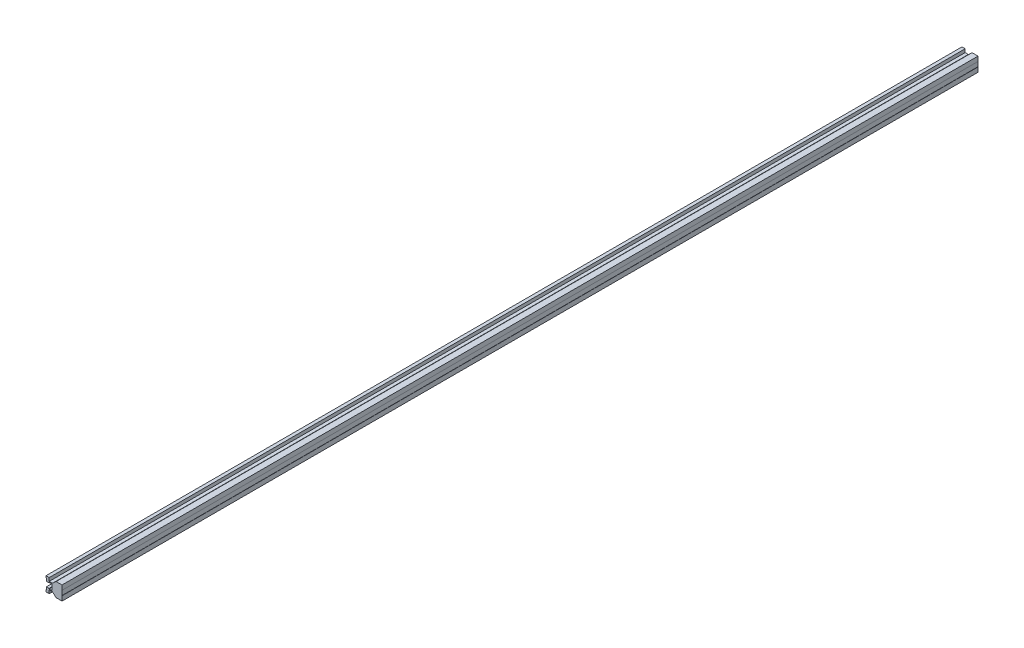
ISO-10303-21;
HEADER;
FILE_DESCRIPTION(('STEP AP214'),'2;1');
FILE_NAME('part.step','',(''),(''),'','','');
FILE_SCHEMA(('AUTOMOTIVE_DESIGN { 1 0 10303 214 1 1 1 1 }'));
ENDSEC;
DATA;
#1=APPLICATION_CONTEXT('core data for automotive mechanical design processes');
#2=APPLICATION_PROTOCOL_DEFINITION('international standard','automotive_design',2000,#1);
#3=PRODUCT_CONTEXT('',#1,'mechanical');
#4=PRODUCT('Part','Part','',(#3));
#5=PRODUCT_RELATED_PRODUCT_CATEGORY('part','',(#4));
#6=PRODUCT_DEFINITION_FORMATION('','',#4);
#7=PRODUCT_DEFINITION_CONTEXT('part definition',#1,'design');
#8=PRODUCT_DEFINITION('design','',#6,#7);
#9=PRODUCT_DEFINITION_SHAPE('','',#8);
#10=(LENGTH_UNIT() NAMED_UNIT(*) SI_UNIT(.MILLI.,.METRE.));
#11=(NAMED_UNIT(*) PLANE_ANGLE_UNIT() SI_UNIT($,.RADIAN.));
#12=(NAMED_UNIT(*) SI_UNIT($,.STERADIAN.) SOLID_ANGLE_UNIT());
#13=UNCERTAINTY_MEASURE_WITH_UNIT(LENGTH_MEASURE(1.E-05),#10,'distance_accuracy_value','');
#14=(GEOMETRIC_REPRESENTATION_CONTEXT(3) GLOBAL_UNCERTAINTY_ASSIGNED_CONTEXT((#13)) GLOBAL_UNIT_ASSIGNED_CONTEXT((#10,
#11,#12)) REPRESENTATION_CONTEXT('',''));
#15=CARTESIAN_POINT('',(0.,0.,0.));
#16=DIRECTION('',(0.,0.,1.));
#17=DIRECTION('',(1.,0.,0.));
#18=AXIS2_PLACEMENT_3D('',#15,#16,#17);
#19=CARTESIAN_POINT('',(1772.75,-14.8,12.));
#20=DIRECTION('',(0.,-1.,0.));
#21=DIRECTION('',(0.,0.,-1.));
#22=AXIS2_PLACEMENT_3D('',#19,#20,#21);
#23=PLANE('',#22);
#24=DIRECTION('',(1.,0.,0.));
#25=VECTOR('',#24,1.);
#26=CARTESIAN_POINT('',(1772.75,-14.8,12.));
#27=LINE('',#26,#25);
#28=CARTESIAN_POINT('',(1772.5,-14.8,12.));
#29=VERTEX_POINT('',#28);
#30=CARTESIAN_POINT('',(1773.,-14.8,12.));
#31=VERTEX_POINT('',#30);
#32=EDGE_CURVE('E336',#29,#31,#27,.T.);
#33=ORIENTED_EDGE('',*,*,#32,.T.);
#34=DIRECTION('',(0.,0.,-1.));
#35=VECTOR('',#34,1.);
#36=CARTESIAN_POINT('',(1773.,-14.8,12.));
#37=LINE('',#36,#35);
#38=CARTESIAN_POINT('',(1773.,-14.8,2012.));
#39=VERTEX_POINT('',#38);
#40=EDGE_CURVE('E315',#39,#31,#37,.T.);
#41=ORIENTED_EDGE('',*,*,#40,.F.);
#42=DIRECTION('',(1.,0.,0.));
#43=VECTOR('',#42,1.);
#44=CARTESIAN_POINT('',(1772.75,-14.8,2012.));
#45=LINE('',#44,#43);
#46=CARTESIAN_POINT('',(1772.5,-14.8,2012.));
#47=VERTEX_POINT('',#46);
#48=EDGE_CURVE('E20',#39,#47,#45,.F.);
#49=ORIENTED_EDGE('',*,*,#48,.T.);
#50=DIRECTION('',(0.,0.,-1.));
#51=VECTOR('',#50,1.);
#52=CARTESIAN_POINT('',(1772.5,-14.8,12.));
#53=LINE('',#52,#51);
#54=EDGE_CURVE('E221',#29,#47,#53,.F.);
#55=ORIENTED_EDGE('',*,*,#54,.F.);
#56=EDGE_LOOP('',(#33,#41,#49,#55));
#57=FACE_BOUND('',#56,.T.);
#58=ADVANCED_FACE('F17',(#57),#23,.T.);
#59=CARTESIAN_POINT('',(1738.5,-8.7,12.));
#60=DIRECTION('',(0.,-1.,0.));
#61=DIRECTION('',(0.,0.,-1.));
#62=AXIS2_PLACEMENT_3D('',#59,#60,#61);
#63=PLANE('',#62);
#64=DIRECTION('',(1.,0.,0.));
#65=VECTOR('',#64,1.);
#66=CARTESIAN_POINT('',(1738.5,-8.7,12.));
#67=LINE('',#66,#65);
#68=CARTESIAN_POINT('',(1738.,-8.7,12.));
#69=VERTEX_POINT('',#68);
#70=CARTESIAN_POINT('',(1739.,-8.7,12.));
#71=VERTEX_POINT('',#70);
#72=EDGE_CURVE('E333',#69,#71,#67,.T.);
#73=ORIENTED_EDGE('',*,*,#72,.T.);
#74=DIRECTION('',(0.,0.,1.));
#75=VECTOR('',#74,1.);
#76=CARTESIAN_POINT('',(1739.,-8.7,12.));
#77=LINE('',#76,#75);
#78=CARTESIAN_POINT('',(1739.,-8.7,2012.));
#79=VERTEX_POINT('',#78);
#80=EDGE_CURVE('E283',#79,#71,#77,.F.);
#81=ORIENTED_EDGE('',*,*,#80,.F.);
#82=DIRECTION('',(1.,0.,0.));
#83=VECTOR('',#82,1.);
#84=CARTESIAN_POINT('',(1738.5,-8.7,2012.));
#85=LINE('',#84,#83);
#86=CARTESIAN_POINT('',(1738.,-8.7,2012.));
#87=VERTEX_POINT('',#86);
#88=EDGE_CURVE('E335',#79,#87,#85,.F.);
#89=ORIENTED_EDGE('',*,*,#88,.T.);
#90=DIRECTION('',(0.,0.,1.));
#91=VECTOR('',#90,1.);
#92=CARTESIAN_POINT('',(1738.,-8.7,12.));
#93=LINE('',#92,#91);
#94=EDGE_CURVE('E287',#69,#87,#93,.T.);
#95=ORIENTED_EDGE('',*,*,#94,.F.);
#96=EDGE_LOOP('',(#73,#81,#89,#95));
#97=FACE_BOUND('',#96,.T.);
#98=ADVANCED_FACE('F439',(#97),#63,.T.);
#99=CARTESIAN_POINT('',(1745.,-14.4,12.));
#100=DIRECTION('',(1.,0.,0.));
#101=DIRECTION('',(0.,0.,-1.));
#102=AXIS2_PLACEMENT_3D('',#99,#100,#101);
#103=PLANE('',#102);
#104=DIRECTION('',(0.,1.,0.));
#105=VECTOR('',#104,1.);
#106=CARTESIAN_POINT('',(1745.,-14.4,12.));
#107=LINE('',#106,#105);
#108=CARTESIAN_POINT('',(1745.,-14.9,12.));
#109=VERTEX_POINT('',#108);
#110=CARTESIAN_POINT('',(1745.,-13.9,12.));
#111=VERTEX_POINT('',#110);
#112=EDGE_CURVE('E329',#109,#111,#107,.T.);
#113=ORIENTED_EDGE('',*,*,#112,.T.);
#114=DIRECTION('',(0.,0.,-1.));
#115=VECTOR('',#114,1.);
#116=CARTESIAN_POINT('',(1745.,-13.9,12.));
#117=LINE('',#116,#115);
#118=CARTESIAN_POINT('',(1745.,-13.9,2012.));
#119=VERTEX_POINT('',#118);
#120=EDGE_CURVE('E271',#119,#111,#117,.T.);
#121=ORIENTED_EDGE('',*,*,#120,.F.);
#122=DIRECTION('',(0.,1.,0.));
#123=VECTOR('',#122,1.);
#124=CARTESIAN_POINT('',(1745.,-14.4,2012.));
#125=LINE('',#124,#123);
#126=CARTESIAN_POINT('',(1745.,-14.9,2012.));
#127=VERTEX_POINT('',#126);
#128=EDGE_CURVE('E331',#119,#127,#125,.F.);
#129=ORIENTED_EDGE('',*,*,#128,.T.);
#130=DIRECTION('',(0.,0.,-1.));
#131=VECTOR('',#130,1.);
#132=CARTESIAN_POINT('',(1745.,-14.9,12.));
#133=LINE('',#132,#131);
#134=EDGE_CURVE('E275',#109,#127,#133,.F.);
#135=ORIENTED_EDGE('',*,*,#134,.F.);
#136=EDGE_LOOP('',(#113,#121,#129,#135));
#137=FACE_BOUND('',#136,.T.);
#138=ADVANCED_FACE('F453',(#137),#103,.T.);
#139=CARTESIAN_POINT('',(1745.,-25.6,12.));
#140=DIRECTION('',(1.,0.,0.));
#141=DIRECTION('',(0.,0.,-1.));
#142=AXIS2_PLACEMENT_3D('',#139,#140,#141);
#143=PLANE('',#142);
#144=DIRECTION('',(0.,1.,0.));
#145=VECTOR('',#144,1.);
#146=CARTESIAN_POINT('',(1745.,-25.6,12.));
#147=LINE('',#146,#145);
#148=CARTESIAN_POINT('',(1745.,-26.1,12.));
#149=VERTEX_POINT('',#148);
#150=CARTESIAN_POINT('',(1745.,-25.1,12.));
#151=VERTEX_POINT('',#150);
#152=EDGE_CURVE('E325',#149,#151,#147,.T.);
#153=ORIENTED_EDGE('',*,*,#152,.T.);
#154=DIRECTION('',(0.,0.,1.));
#155=VECTOR('',#154,1.);
#156=CARTESIAN_POINT('',(1745.,-25.1,12.));
#157=LINE('',#156,#155);
#158=CARTESIAN_POINT('',(1745.,-25.1,2012.));
#159=VERTEX_POINT('',#158);
#160=EDGE_CURVE('E255',#159,#151,#157,.F.);
#161=ORIENTED_EDGE('',*,*,#160,.F.);
#162=DIRECTION('',(0.,1.,0.));
#163=VECTOR('',#162,1.);
#164=CARTESIAN_POINT('',(1745.,-25.6,2012.));
#165=LINE('',#164,#163);
#166=CARTESIAN_POINT('',(1745.,-26.1,2012.));
#167=VERTEX_POINT('',#166);
#168=EDGE_CURVE('E327',#159,#167,#165,.F.);
#169=ORIENTED_EDGE('',*,*,#168,.T.);
#170=DIRECTION('',(0.,0.,1.));
#171=VECTOR('',#170,1.);
#172=CARTESIAN_POINT('',(1745.,-26.1,12.));
#173=LINE('',#172,#171);
#174=EDGE_CURVE('E259',#149,#167,#173,.T.);
#175=ORIENTED_EDGE('',*,*,#174,.F.);
#176=EDGE_LOOP('',(#153,#161,#169,#175));
#177=FACE_BOUND('',#176,.T.);
#178=ADVANCED_FACE('F471',(#177),#143,.T.);
#179=CARTESIAN_POINT('',(1738.5,-31.3,12.));
#180=DIRECTION('',(0.,1.,0.));
#181=DIRECTION('',(0.,0.,1.));
#182=AXIS2_PLACEMENT_3D('',#179,#180,#181);
#183=PLANE('',#182);
#184=DIRECTION('',(1.,0.,0.));
#185=VECTOR('',#184,1.);
#186=CARTESIAN_POINT('',(1738.5,-31.3,12.));
#187=LINE('',#186,#185);
#188=CARTESIAN_POINT('',(1739.,-31.3,12.));
#189=VERTEX_POINT('',#188);
#190=CARTESIAN_POINT('',(1738.,-31.3,12.));
#191=VERTEX_POINT('',#190);
#192=EDGE_CURVE('E321',#189,#191,#187,.F.);
#193=ORIENTED_EDGE('',*,*,#192,.T.);
#194=DIRECTION('',(0.,0.,1.));
#195=VECTOR('',#194,1.);
#196=CARTESIAN_POINT('',(1738.,-31.3,12.));
#197=LINE('',#196,#195);
#198=CARTESIAN_POINT('',(1738.,-31.3,2012.));
#199=VERTEX_POINT('',#198);
#200=EDGE_CURVE('E243',#199,#191,#197,.F.);
#201=ORIENTED_EDGE('',*,*,#200,.F.);
#202=DIRECTION('',(1.,0.,0.));
#203=VECTOR('',#202,1.);
#204=CARTESIAN_POINT('',(1738.5,-31.3,2012.));
#205=LINE('',#204,#203);
#206=CARTESIAN_POINT('',(1739.,-31.3,2012.));
#207=VERTEX_POINT('',#206);
#208=EDGE_CURVE('E323',#199,#207,#205,.T.);
#209=ORIENTED_EDGE('',*,*,#208,.T.);
#210=DIRECTION('',(0.,0.,1.));
#211=VECTOR('',#210,1.);
#212=CARTESIAN_POINT('',(1739.,-31.3,12.));
#213=LINE('',#212,#211);
#214=EDGE_CURVE('E247',#189,#207,#213,.T.);
#215=ORIENTED_EDGE('',*,*,#214,.F.);
#216=EDGE_LOOP('',(#193,#201,#209,#215));
#217=FACE_BOUND('',#216,.T.);
#218=ADVANCED_FACE('F485',(#217),#183,.T.);
#219=CARTESIAN_POINT('',(1772.5,-20.,12.));
#220=DIRECTION('',(1.,0.,0.));
#221=DIRECTION('',(0.,0.,-1.));
#222=AXIS2_PLACEMENT_3D('',#219,#220,#221);
#223=PLANE('',#222);
#224=DIRECTION('',(0.,1.,0.));
#225=VECTOR('',#224,1.);
#226=CARTESIAN_POINT('',(1772.5,-20.,12.));
#227=LINE('',#226,#225);
#228=CARTESIAN_POINT('',(1772.5,-25.2,12.));
#229=VERTEX_POINT('',#228);
#230=EDGE_CURVE('E347',#229,#29,#227,.T.);
#231=ORIENTED_EDGE('',*,*,#230,.T.);
#232=ORIENTED_EDGE('',*,*,#54,.T.);
#233=DIRECTION('',(0.,1.,0.));
#234=VECTOR('',#233,1.);
#235=CARTESIAN_POINT('',(1772.5,-20.,2012.));
#236=LINE('',#235,#234);
#237=CARTESIAN_POINT('',(1772.5,-25.2,2012.));
#238=VERTEX_POINT('',#237);
#239=EDGE_CURVE('E219',#238,#47,#236,.T.);
#240=ORIENTED_EDGE('',*,*,#239,.F.);
#241=DIRECTION('',(0.,0.,1.));
#242=VECTOR('',#241,1.);
#243=CARTESIAN_POINT('',(1772.5,-25.2,12.));
#244=LINE('',#243,#242);
#245=EDGE_CURVE('E204',#229,#238,#244,.T.);
#246=ORIENTED_EDGE('',*,*,#245,.F.);
#247=EDGE_LOOP('',(#231,#232,#240,#246));
#248=FACE_BOUND('',#247,.T.);
#249=ADVANCED_FACE('F220',(#248),#223,.T.);
#250=CARTESIAN_POINT('',(1773.,-9.75,12.));
#251=DIRECTION('',(1.,0.,0.));
#252=DIRECTION('',(0.,0.,-1.));
#253=AXIS2_PLACEMENT_3D('',#250,#251,#252);
#254=PLANE('',#253);
#255=DIRECTION('',(0.,1.,0.));
#256=VECTOR('',#255,1.);
#257=CARTESIAN_POINT('',(1773.,-20.,12.));
#258=LINE('',#257,#256);
#259=CARTESIAN_POINT('',(1773.,-4.7,12.));
#260=VERTEX_POINT('',#259);
#261=EDGE_CURVE('E341',#31,#260,#258,.T.);
#262=ORIENTED_EDGE('',*,*,#261,.T.);
#263=DIRECTION('',(0.,0.,1.));
#264=VECTOR('',#263,1.);
#265=CARTESIAN_POINT('',(1773.,-4.7,12.));
#266=LINE('',#265,#264);
#267=CARTESIAN_POINT('',(1773.,-4.7,2012.));
#268=VERTEX_POINT('',#267);
#269=EDGE_CURVE('E311',#268,#260,#266,.F.);
#270=ORIENTED_EDGE('',*,*,#269,.F.);
#271=DIRECTION('',(0.,1.,0.));
#272=VECTOR('',#271,1.);
#273=CARTESIAN_POINT('',(1773.,-20.,2012.));
#274=LINE('',#273,#272);
#275=EDGE_CURVE('E223',#39,#268,#274,.T.);
#276=ORIENTED_EDGE('',*,*,#275,.F.);
#277=ORIENTED_EDGE('',*,*,#40,.T.);
#278=EDGE_LOOP('',(#262,#270,#276,#277));
#279=FACE_BOUND('',#278,.T.);
#280=ADVANCED_FACE('F340',(#279),#254,.T.);
#281=CARTESIAN_POINT('',(1766.5,-4.7,12.));
#282=DIRECTION('',(0.,1.,0.));
#283=DIRECTION('',(0.,0.,1.));
#284=AXIS2_PLACEMENT_3D('',#281,#282,#283);
#285=PLANE('',#284);
#286=DIRECTION('',(1.,0.,0.));
#287=VECTOR('',#286,1.);
#288=CARTESIAN_POINT('',(1753.80417748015,-4.7,12.));
#289=LINE('',#288,#287);
#290=CARTESIAN_POINT('',(1760.,-4.7,12.));
#291=VERTEX_POINT('',#290);
#292=EDGE_CURVE('E346',#260,#291,#289,.F.);
#293=ORIENTED_EDGE('',*,*,#292,.T.);
#294=DIRECTION('',(0.,0.,1.));
#295=VECTOR('',#294,1.);
#296=CARTESIAN_POINT('',(1760.,-4.7,12.));
#297=LINE('',#296,#295);
#298=CARTESIAN_POINT('',(1760.,-4.7,2012.));
#299=VERTEX_POINT('',#298);
#300=EDGE_CURVE('E307',#299,#291,#297,.F.);
#301=ORIENTED_EDGE('',*,*,#300,.F.);
#302=DIRECTION('',(1.,0.,0.));
#303=VECTOR('',#302,1.);
#304=CARTESIAN_POINT('',(1753.80417748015,-4.7,2012.));
#305=LINE('',#304,#303);
#306=EDGE_CURVE('E408',#268,#299,#305,.F.);
#307=ORIENTED_EDGE('',*,*,#306,.F.);
#308=ORIENTED_EDGE('',*,*,#269,.T.);
#309=EDGE_LOOP('',(#293,#301,#307,#308));
#310=FACE_BOUND('',#309,.T.);
#311=ADVANCED_FACE('F413',(#310),#285,.T.);
#312=CARTESIAN_POINT('',(1756.,-8.35,12.));
#313=DIRECTION('',(-0.674050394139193,0.738685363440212,0.));
#314=DIRECTION('',(-0.738685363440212,-0.674050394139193,0.));
#315=AXIS2_PLACEMENT_3D('',#312,#313,#314);
#316=PLANE('',#315);
#317=DIRECTION('',(-0.738685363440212,-0.674050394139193,0.));
#318=VECTOR('',#317,1.);
#319=CARTESIAN_POINT('',(1760.,-4.7,12.));
#320=LINE('',#319,#318);
#321=CARTESIAN_POINT('',(1752.,-12.,12.));
#322=VERTEX_POINT('',#321);
#323=EDGE_CURVE('E349',#291,#322,#320,.T.);
#324=ORIENTED_EDGE('',*,*,#323,.T.);
#325=DIRECTION('',(0.,0.,1.));
#326=VECTOR('',#325,1.);
#327=CARTESIAN_POINT('',(1752.,-12.,12.));
#328=LINE('',#327,#326);
#329=CARTESIAN_POINT('',(1752.,-12.,2012.));
#330=VERTEX_POINT('',#329);
#331=EDGE_CURVE('E303',#330,#322,#328,.F.);
#332=ORIENTED_EDGE('',*,*,#331,.F.);
#333=DIRECTION('',(-0.738685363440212,-0.674050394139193,0.));
#334=VECTOR('',#333,1.);
#335=CARTESIAN_POINT('',(1760.,-4.7,2012.));
#336=LINE('',#335,#334);
#337=EDGE_CURVE('E405',#299,#330,#336,.T.);
#338=ORIENTED_EDGE('',*,*,#337,.F.);
#339=ORIENTED_EDGE('',*,*,#300,.T.);
#340=EDGE_LOOP('',(#324,#332,#338,#339));
#341=FACE_BOUND('',#340,.T.);
#342=ADVANCED_FACE('F415',(#341),#316,.T.);
#343=CARTESIAN_POINT('',(1748.5,-12.,12.));
#344=DIRECTION('',(0.,1.,0.));
#345=DIRECTION('',(0.,0.,1.));
#346=AXIS2_PLACEMENT_3D('',#343,#344,#345);
#347=PLANE('',#346);
#348=DIRECTION('',(1.,0.,0.));
#349=VECTOR('',#348,1.);
#350=CARTESIAN_POINT('',(1753.80417748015,-12.,12.));
#351=LINE('',#350,#349);
#352=CARTESIAN_POINT('',(1745.,-12.,12.));
#353=VERTEX_POINT('',#352);
#354=EDGE_CURVE('E549',#322,#353,#351,.F.);
#355=ORIENTED_EDGE('',*,*,#354,.T.);
#356=DIRECTION('',(0.,0.,-1.));
#357=VECTOR('',#356,1.);
#358=CARTESIAN_POINT('',(1745.,-12.,12.));
#359=LINE('',#358,#357);
#360=CARTESIAN_POINT('',(1745.,-12.,2012.));
#361=VERTEX_POINT('',#360);
#362=EDGE_CURVE('E299',#361,#353,#359,.T.);
#363=ORIENTED_EDGE('',*,*,#362,.F.);
#364=DIRECTION('',(1.,0.,0.));
#365=VECTOR('',#364,1.);
#366=CARTESIAN_POINT('',(1753.80417748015,-12.,2012.));
#367=LINE('',#366,#365);
#368=EDGE_CURVE('E402',#330,#361,#367,.F.);
#369=ORIENTED_EDGE('',*,*,#368,.F.);
#370=ORIENTED_EDGE('',*,*,#331,.T.);
#371=EDGE_LOOP('',(#355,#363,#369,#370));
#372=FACE_BOUND('',#371,.T.);
#373=ADVANCED_FACE('F419',(#372),#347,.T.);
#374=CARTESIAN_POINT('',(1745.,-8.35,12.));
#375=DIRECTION('',(1.,0.,0.));
#376=DIRECTION('',(0.,0.,-1.));
#377=AXIS2_PLACEMENT_3D('',#374,#375,#376);
#378=PLANE('',#377);
#379=DIRECTION('',(0.,1.,0.));
#380=VECTOR('',#379,1.);
#381=CARTESIAN_POINT('',(1745.,-20.,12.));
#382=LINE('',#381,#380);
#383=CARTESIAN_POINT('',(1745.,-4.7,12.));
#384=VERTEX_POINT('',#383);
#385=EDGE_CURVE('E425',#353,#384,#382,.T.);
#386=ORIENTED_EDGE('',*,*,#385,.T.);
#387=DIRECTION('',(0.,0.,1.));
#388=VECTOR('',#387,1.);
#389=CARTESIAN_POINT('',(1745.,-4.7,12.));
#390=LINE('',#389,#388);
#391=CARTESIAN_POINT('',(1745.,-4.7,2012.));
#392=VERTEX_POINT('',#391);
#393=EDGE_CURVE('E295',#392,#384,#390,.F.);
#394=ORIENTED_EDGE('',*,*,#393,.F.);
#395=DIRECTION('',(0.,1.,0.));
#396=VECTOR('',#395,1.);
#397=CARTESIAN_POINT('',(1745.,-20.,2012.));
#398=LINE('',#397,#396);
#399=EDGE_CURVE('E399',#361,#392,#398,.T.);
#400=ORIENTED_EDGE('',*,*,#399,.F.);
#401=ORIENTED_EDGE('',*,*,#362,.T.);
#402=EDGE_LOOP('',(#386,#394,#400,#401));
#403=FACE_BOUND('',#402,.T.);
#404=ADVANCED_FACE('F423',(#403),#378,.T.);
#405=CARTESIAN_POINT('',(1741.5,-4.7,12.));
#406=DIRECTION('',(0.,1.,0.));
#407=DIRECTION('',(0.,0.,1.));
#408=AXIS2_PLACEMENT_3D('',#405,#406,#407);
#409=PLANE('',#408);
#410=DIRECTION('',(1.,0.,0.));
#411=VECTOR('',#410,1.);
#412=CARTESIAN_POINT('',(1753.80417748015,-4.7,12.));
#413=LINE('',#412,#411);
#414=CARTESIAN_POINT('',(1738.,-4.7,12.));
#415=VERTEX_POINT('',#414);
#416=EDGE_CURVE('E430',#384,#415,#413,.F.);
#417=ORIENTED_EDGE('',*,*,#416,.T.);
#418=DIRECTION('',(0.,0.,1.));
#419=VECTOR('',#418,1.);
#420=CARTESIAN_POINT('',(1738.,-4.7,12.));
#421=LINE('',#420,#419);
#422=CARTESIAN_POINT('',(1738.,-4.7,2012.));
#423=VERTEX_POINT('',#422);
#424=EDGE_CURVE('E291',#423,#415,#421,.F.);
#425=ORIENTED_EDGE('',*,*,#424,.F.);
#426=DIRECTION('',(1.,0.,0.));
#427=VECTOR('',#426,1.);
#428=CARTESIAN_POINT('',(1753.80417748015,-4.7,2012.));
#429=LINE('',#428,#427);
#430=EDGE_CURVE('E396',#392,#423,#429,.F.);
#431=ORIENTED_EDGE('',*,*,#430,.F.);
#432=ORIENTED_EDGE('',*,*,#393,.T.);
#433=EDGE_LOOP('',(#417,#425,#431,#432));
#434=FACE_BOUND('',#433,.T.);
#435=ADVANCED_FACE('F428',(#434),#409,.T.);
#436=CARTESIAN_POINT('',(1738.,-6.7,12.));
#437=DIRECTION('',(-1.,0.,0.));
#438=DIRECTION('',(0.,0.,1.));
#439=AXIS2_PLACEMENT_3D('',#436,#437,#438);
#440=PLANE('',#439);
#441=DIRECTION('',(0.,1.,0.));
#442=VECTOR('',#441,1.);
#443=CARTESIAN_POINT('',(1738.,-20.,12.));
#444=LINE('',#443,#442);
#445=EDGE_CURVE('E545',#415,#69,#444,.F.);
#446=ORIENTED_EDGE('',*,*,#445,.T.);
#447=ORIENTED_EDGE('',*,*,#94,.T.);
#448=DIRECTION('',(0.,1.,0.));
#449=VECTOR('',#448,1.);
#450=CARTESIAN_POINT('',(1738.,-20.,2012.));
#451=LINE('',#450,#449);
#452=EDGE_CURVE('E393',#423,#87,#451,.F.);
#453=ORIENTED_EDGE('',*,*,#452,.F.);
#454=ORIENTED_EDGE('',*,*,#424,.T.);
#455=EDGE_LOOP('',(#446,#447,#453,#454));
#456=FACE_BOUND('',#455,.T.);
#457=ADVANCED_FACE('F434',(#456),#440,.T.);
#458=CARTESIAN_POINT('',(1739.,-11.8,12.));
#459=DIRECTION('',(-1.,0.,0.));
#460=DIRECTION('',(0.,0.,1.));
#461=AXIS2_PLACEMENT_3D('',#458,#459,#460);
#462=PLANE('',#461);
#463=DIRECTION('',(0.,1.,0.));
#464=VECTOR('',#463,1.);
#465=CARTESIAN_POINT('',(1739.,-20.,12.));
#466=LINE('',#465,#464);
#467=CARTESIAN_POINT('',(1739.,-14.9,12.));
#468=VERTEX_POINT('',#467);
#469=EDGE_CURVE('E444',#71,#468,#466,.F.);
#470=ORIENTED_EDGE('',*,*,#469,.T.);
#471=DIRECTION('',(0.,0.,-1.));
#472=VECTOR('',#471,1.);
#473=CARTESIAN_POINT('',(1739.,-14.9,12.));
#474=LINE('',#473,#472);
#475=CARTESIAN_POINT('',(1739.,-14.9,2012.));
#476=VERTEX_POINT('',#475);
#477=EDGE_CURVE('E279',#476,#468,#474,.T.);
#478=ORIENTED_EDGE('',*,*,#477,.F.);
#479=DIRECTION('',(0.,1.,0.));
#480=VECTOR('',#479,1.);
#481=CARTESIAN_POINT('',(1739.,-20.,2012.));
#482=LINE('',#481,#480);
#483=EDGE_CURVE('E390',#79,#476,#482,.F.);
#484=ORIENTED_EDGE('',*,*,#483,.F.);
#485=ORIENTED_EDGE('',*,*,#80,.T.);
#486=EDGE_LOOP('',(#470,#478,#484,#485));
#487=FACE_BOUND('',#486,.T.);
#488=ADVANCED_FACE('F442',(#487),#462,.T.);
#489=CARTESIAN_POINT('',(1742.,-14.9,12.));
#490=DIRECTION('',(0.,-1.,0.));
#491=DIRECTION('',(0.,0.,-1.));
#492=AXIS2_PLACEMENT_3D('',#489,#490,#491);
#493=PLANE('',#492);
#494=DIRECTION('',(1.,0.,0.));
#495=VECTOR('',#494,1.);
#496=CARTESIAN_POINT('',(1753.80417748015,-14.9,12.));
#497=LINE('',#496,#495);
#498=EDGE_CURVE('E542',#468,#109,#497,.T.);
#499=ORIENTED_EDGE('',*,*,#498,.T.);
#500=ORIENTED_EDGE('',*,*,#134,.T.);
#501=DIRECTION('',(1.,0.,0.));
#502=VECTOR('',#501,1.);
#503=CARTESIAN_POINT('',(1753.80417748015,-14.9,2012.));
#504=LINE('',#503,#502);
#505=EDGE_CURVE('E387',#476,#127,#504,.T.);
#506=ORIENTED_EDGE('',*,*,#505,.F.);
#507=ORIENTED_EDGE('',*,*,#477,.T.);
#508=EDGE_LOOP('',(#499,#500,#506,#507));
#509=FACE_BOUND('',#508,.T.);
#510=ADVANCED_FACE('F448',(#509),#493,.T.);
#511=CARTESIAN_POINT('',(1748.,-13.9,12.));
#512=DIRECTION('',(0.,-1.,0.));
#513=DIRECTION('',(0.,0.,-1.));
#514=AXIS2_PLACEMENT_3D('',#511,#512,#513);
#515=PLANE('',#514);
#516=DIRECTION('',(1.,0.,0.));
#517=VECTOR('',#516,1.);
#518=CARTESIAN_POINT('',(1753.80417748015,-13.9,12.));
#519=LINE('',#518,#517);
#520=CARTESIAN_POINT('',(1751.,-13.9,12.));
#521=VERTEX_POINT('',#520);
#522=EDGE_CURVE('E458',#111,#521,#519,.T.);
#523=ORIENTED_EDGE('',*,*,#522,.T.);
#524=DIRECTION('',(0.,0.,1.));
#525=VECTOR('',#524,1.);
#526=CARTESIAN_POINT('',(1751.,-13.9,12.));
#527=LINE('',#526,#525);
#528=CARTESIAN_POINT('',(1751.,-13.9,2012.));
#529=VERTEX_POINT('',#528);
#530=EDGE_CURVE('E267',#529,#521,#527,.F.);
#531=ORIENTED_EDGE('',*,*,#530,.F.);
#532=DIRECTION('',(1.,0.,0.));
#533=VECTOR('',#532,1.);
#534=CARTESIAN_POINT('',(1753.80417748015,-13.9,2012.));
#535=LINE('',#534,#533);
#536=EDGE_CURVE('E384',#119,#529,#535,.T.);
#537=ORIENTED_EDGE('',*,*,#536,.F.);
#538=ORIENTED_EDGE('',*,*,#120,.T.);
#539=EDGE_LOOP('',(#523,#531,#537,#538));
#540=FACE_BOUND('',#539,.T.);
#541=ADVANCED_FACE('F456',(#540),#515,.T.);
#542=CARTESIAN_POINT('',(1751.,-20.,12.));
#543=DIRECTION('',(-1.,0.,0.));
#544=DIRECTION('',(0.,0.,1.));
#545=AXIS2_PLACEMENT_3D('',#542,#543,#544);
#546=PLANE('',#545);
#547=DIRECTION('',(0.,1.,0.));
#548=VECTOR('',#547,1.);
#549=CARTESIAN_POINT('',(1751.,-20.,12.));
#550=LINE('',#549,#548);
#551=CARTESIAN_POINT('',(1751.,-26.1,12.));
#552=VERTEX_POINT('',#551);
#553=EDGE_CURVE('E539',#521,#552,#550,.F.);
#554=ORIENTED_EDGE('',*,*,#553,.T.);
#555=DIRECTION('',(0.,0.,1.));
#556=VECTOR('',#555,1.);
#557=CARTESIAN_POINT('',(1751.,-26.1,12.));
#558=LINE('',#557,#556);
#559=CARTESIAN_POINT('',(1751.,-26.1,2012.));
#560=VERTEX_POINT('',#559);
#561=EDGE_CURVE('E263',#560,#552,#558,.F.);
#562=ORIENTED_EDGE('',*,*,#561,.F.);
#563=DIRECTION('',(0.,1.,0.));
#564=VECTOR('',#563,1.);
#565=CARTESIAN_POINT('',(1751.,-20.,2012.));
#566=LINE('',#565,#564);
#567=EDGE_CURVE('E381',#529,#560,#566,.F.);
#568=ORIENTED_EDGE('',*,*,#567,.F.);
#569=ORIENTED_EDGE('',*,*,#530,.T.);
#570=EDGE_LOOP('',(#554,#562,#568,#569));
#571=FACE_BOUND('',#570,.T.);
#572=ADVANCED_FACE('F461',(#571),#546,.T.);
#573=CARTESIAN_POINT('',(1748.,-26.1,12.));
#574=DIRECTION('',(0.,1.,0.));
#575=DIRECTION('',(0.,0.,1.));
#576=AXIS2_PLACEMENT_3D('',#573,#574,#575);
#577=PLANE('',#576);
#578=DIRECTION('',(1.,0.,0.));
#579=VECTOR('',#578,1.);
#580=CARTESIAN_POINT('',(1753.80417748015,-26.1,12.));
#581=LINE('',#580,#579);
#582=EDGE_CURVE('E469',#552,#149,#581,.F.);
#583=ORIENTED_EDGE('',*,*,#582,.T.);
#584=ORIENTED_EDGE('',*,*,#174,.T.);
#585=DIRECTION('',(1.,0.,0.));
#586=VECTOR('',#585,1.);
#587=CARTESIAN_POINT('',(1753.80417748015,-26.1,2012.));
#588=LINE('',#587,#586);
#589=EDGE_CURVE('E378',#560,#167,#588,.F.);
#590=ORIENTED_EDGE('',*,*,#589,.F.);
#591=ORIENTED_EDGE('',*,*,#561,.T.);
#592=EDGE_LOOP('',(#583,#584,#590,#591));
#593=FACE_BOUND('',#592,.T.);
#594=ADVANCED_FACE('F466',(#593),#577,.T.);
#595=CARTESIAN_POINT('',(1742.,-25.1,12.));
#596=DIRECTION('',(0.,1.,0.));
#597=DIRECTION('',(0.,0.,1.));
#598=AXIS2_PLACEMENT_3D('',#595,#596,#597);
#599=PLANE('',#598);
#600=DIRECTION('',(1.,0.,0.));
#601=VECTOR('',#600,1.);
#602=CARTESIAN_POINT('',(1753.80417748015,-25.1,12.));
#603=LINE('',#602,#601);
#604=CARTESIAN_POINT('',(1739.,-25.1,12.));
#605=VERTEX_POINT('',#604);
#606=EDGE_CURVE('E536',#151,#605,#603,.F.);
#607=ORIENTED_EDGE('',*,*,#606,.T.);
#608=DIRECTION('',(0.,0.,1.));
#609=VECTOR('',#608,1.);
#610=CARTESIAN_POINT('',(1739.,-25.1,12.));
#611=LINE('',#610,#609);
#612=CARTESIAN_POINT('',(1739.,-25.1,2012.));
#613=VERTEX_POINT('',#612);
#614=EDGE_CURVE('E251',#613,#605,#611,.F.);
#615=ORIENTED_EDGE('',*,*,#614,.F.);
#616=DIRECTION('',(1.,0.,0.));
#617=VECTOR('',#616,1.);
#618=CARTESIAN_POINT('',(1753.80417748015,-25.1,2012.));
#619=LINE('',#618,#617);
#620=EDGE_CURVE('E375',#159,#613,#619,.F.);
#621=ORIENTED_EDGE('',*,*,#620,.F.);
#622=ORIENTED_EDGE('',*,*,#160,.T.);
#623=EDGE_LOOP('',(#607,#615,#621,#622));
#624=FACE_BOUND('',#623,.T.);
#625=ADVANCED_FACE('F475',(#624),#599,.T.);
#626=CARTESIAN_POINT('',(1739.,-28.2,12.));
#627=DIRECTION('',(-1.,0.,0.));
#628=DIRECTION('',(0.,0.,1.));
#629=AXIS2_PLACEMENT_3D('',#626,#627,#628);
#630=PLANE('',#629);
#631=DIRECTION('',(0.,1.,0.));
#632=VECTOR('',#631,1.);
#633=CARTESIAN_POINT('',(1739.,-20.,12.));
#634=LINE('',#633,#632);
#635=EDGE_CURVE('E483',#605,#189,#634,.F.);
#636=ORIENTED_EDGE('',*,*,#635,.T.);
#637=ORIENTED_EDGE('',*,*,#214,.T.);
#638=DIRECTION('',(0.,1.,0.));
#639=VECTOR('',#638,1.);
#640=CARTESIAN_POINT('',(1739.,-20.,2012.));
#641=LINE('',#640,#639);
#642=EDGE_CURVE('E372',#613,#207,#641,.F.);
#643=ORIENTED_EDGE('',*,*,#642,.F.);
#644=ORIENTED_EDGE('',*,*,#614,.T.);
#645=EDGE_LOOP('',(#636,#637,#643,#644));
#646=FACE_BOUND('',#645,.T.);
#647=ADVANCED_FACE('F480',(#646),#630,.T.);
#648=CARTESIAN_POINT('',(1738.,-33.3,12.));
#649=DIRECTION('',(-1.,0.,0.));
#650=DIRECTION('',(0.,0.,1.));
#651=AXIS2_PLACEMENT_3D('',#648,#649,#650);
#652=PLANE('',#651);
#653=DIRECTION('',(0.,1.,0.));
#654=VECTOR('',#653,1.);
#655=CARTESIAN_POINT('',(1738.,-20.,12.));
#656=LINE('',#655,#654);
#657=CARTESIAN_POINT('',(1738.,-35.3,12.));
#658=VERTEX_POINT('',#657);
#659=EDGE_CURVE('E533',#191,#658,#656,.F.);
#660=ORIENTED_EDGE('',*,*,#659,.T.);
#661=DIRECTION('',(0.,0.,-1.));
#662=VECTOR('',#661,1.);
#663=CARTESIAN_POINT('',(1738.,-35.3,12.));
#664=LINE('',#663,#662);
#665=CARTESIAN_POINT('',(1738.,-35.3,2012.));
#666=VERTEX_POINT('',#665);
#667=EDGE_CURVE('E239',#666,#658,#664,.T.);
#668=ORIENTED_EDGE('',*,*,#667,.F.);
#669=DIRECTION('',(0.,1.,0.));
#670=VECTOR('',#669,1.);
#671=CARTESIAN_POINT('',(1738.,-20.,2012.));
#672=LINE('',#671,#670);
#673=EDGE_CURVE('E369',#199,#666,#672,.F.);
#674=ORIENTED_EDGE('',*,*,#673,.F.);
#675=ORIENTED_EDGE('',*,*,#200,.T.);
#676=EDGE_LOOP('',(#660,#668,#674,#675));
#677=FACE_BOUND('',#676,.T.);
#678=ADVANCED_FACE('F489',(#677),#652,.T.);
#679=CARTESIAN_POINT('',(1741.5,-35.3,12.));
#680=DIRECTION('',(0.,-1.,0.));
#681=DIRECTION('',(0.,0.,-1.));
#682=AXIS2_PLACEMENT_3D('',#679,#680,#681);
#683=PLANE('',#682);
#684=DIRECTION('',(1.,0.,0.));
#685=VECTOR('',#684,1.);
#686=CARTESIAN_POINT('',(1753.80417748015,-35.3,12.));
#687=LINE('',#686,#685);
#688=CARTESIAN_POINT('',(1745.,-35.3,12.));
#689=VERTEX_POINT('',#688);
#690=EDGE_CURVE('E495',#658,#689,#687,.T.);
#691=ORIENTED_EDGE('',*,*,#690,.T.);
#692=DIRECTION('',(0.,0.,-1.));
#693=VECTOR('',#692,1.);
#694=CARTESIAN_POINT('',(1745.,-35.3,12.));
#695=LINE('',#694,#693);
#696=CARTESIAN_POINT('',(1745.,-35.3,2012.));
#697=VERTEX_POINT('',#696);
#698=EDGE_CURVE('E235',#697,#689,#695,.T.);
#699=ORIENTED_EDGE('',*,*,#698,.F.);
#700=DIRECTION('',(1.,0.,0.));
#701=VECTOR('',#700,1.);
#702=CARTESIAN_POINT('',(1753.80417748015,-35.3,2012.));
#703=LINE('',#702,#701);
#704=EDGE_CURVE('E366',#666,#697,#703,.T.);
#705=ORIENTED_EDGE('',*,*,#704,.F.);
#706=ORIENTED_EDGE('',*,*,#667,.T.);
#707=EDGE_LOOP('',(#691,#699,#705,#706));
#708=FACE_BOUND('',#707,.T.);
#709=ADVANCED_FACE('F493',(#708),#683,.T.);
#710=CARTESIAN_POINT('',(1745.,-31.65,12.));
#711=DIRECTION('',(1.,0.,0.));
#712=DIRECTION('',(0.,0.,-1.));
#713=AXIS2_PLACEMENT_3D('',#710,#711,#712);
#714=PLANE('',#713);
#715=DIRECTION('',(0.,1.,0.));
#716=VECTOR('',#715,1.);
#717=CARTESIAN_POINT('',(1745.,-20.,12.));
#718=LINE('',#717,#716);
#719=CARTESIAN_POINT('',(1745.,-28.,12.));
#720=VERTEX_POINT('',#719);
#721=EDGE_CURVE('E500',#689,#720,#718,.T.);
#722=ORIENTED_EDGE('',*,*,#721,.T.);
#723=DIRECTION('',(0.,0.,-1.));
#724=VECTOR('',#723,1.);
#725=CARTESIAN_POINT('',(1745.,-28.,12.));
#726=LINE('',#725,#724);
#727=CARTESIAN_POINT('',(1745.,-28.,2012.));
#728=VERTEX_POINT('',#727);
#729=EDGE_CURVE('E216',#728,#720,#726,.T.);
#730=ORIENTED_EDGE('',*,*,#729,.F.);
#731=DIRECTION('',(0.,1.,0.));
#732=VECTOR('',#731,1.);
#733=CARTESIAN_POINT('',(1745.,-20.,2012.));
#734=LINE('',#733,#732);
#735=EDGE_CURVE('E363',#697,#728,#734,.T.);
#736=ORIENTED_EDGE('',*,*,#735,.F.);
#737=ORIENTED_EDGE('',*,*,#698,.T.);
#738=EDGE_LOOP('',(#722,#730,#736,#737));
#739=FACE_BOUND('',#738,.T.);
#740=ADVANCED_FACE('F498',(#739),#714,.T.);
#741=CARTESIAN_POINT('',(1748.5,-28.,12.));
#742=DIRECTION('',(0.,-1.,0.));
#743=DIRECTION('',(0.,0.,-1.));
#744=AXIS2_PLACEMENT_3D('',#741,#742,#743);
#745=PLANE('',#744);
#746=DIRECTION('',(1.,0.,0.));
#747=VECTOR('',#746,1.);
#748=CARTESIAN_POINT('',(1753.80417748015,-28.,12.));
#749=LINE('',#748,#747);
#750=CARTESIAN_POINT('',(1752.,-28.,12.));
#751=VERTEX_POINT('',#750);
#752=EDGE_CURVE('E529',#720,#751,#749,.T.);
#753=ORIENTED_EDGE('',*,*,#752,.T.);
#754=DIRECTION('',(0.,0.,1.));
#755=VECTOR('',#754,1.);
#756=CARTESIAN_POINT('',(1752.,-28.,12.));
#757=LINE('',#756,#755);
#758=CARTESIAN_POINT('',(1752.,-28.,2012.));
#759=VERTEX_POINT('',#758);
#760=EDGE_CURVE('E351',#759,#751,#757,.F.);
#761=ORIENTED_EDGE('',*,*,#760,.F.);
#762=DIRECTION('',(1.,0.,0.));
#763=VECTOR('',#762,1.);
#764=CARTESIAN_POINT('',(1753.80417748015,-28.,2012.));
#765=LINE('',#764,#763);
#766=EDGE_CURVE('E361',#728,#759,#765,.T.);
#767=ORIENTED_EDGE('',*,*,#766,.F.);
#768=ORIENTED_EDGE('',*,*,#729,.T.);
#769=EDGE_LOOP('',(#753,#761,#767,#768));
#770=FACE_BOUND('',#769,.T.);
#771=ADVANCED_FACE('F504',(#770),#745,.T.);
#772=CARTESIAN_POINT('',(1772.75,-25.2,12.));
#773=DIRECTION('',(0.,1.,0.));
#774=DIRECTION('',(0.,0.,1.));
#775=AXIS2_PLACEMENT_3D('',#772,#773,#774);
#776=PLANE('',#775);
#777=DIRECTION('',(1.,0.,0.));
#778=VECTOR('',#777,1.);
#779=CARTESIAN_POINT('',(1753.80417748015,-25.2,12.));
#780=LINE('',#779,#778);
#781=CARTESIAN_POINT('',(1773.,-25.2,12.));
#782=VERTEX_POINT('',#781);
#783=EDGE_CURVE('E211',#782,#229,#780,.F.);
#784=ORIENTED_EDGE('',*,*,#783,.T.);
#785=ORIENTED_EDGE('',*,*,#245,.T.);
#786=DIRECTION('',(1.,0.,0.));
#787=VECTOR('',#786,1.);
#788=CARTESIAN_POINT('',(1753.80417748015,-25.2,2012.));
#789=LINE('',#788,#787);
#790=CARTESIAN_POINT('',(1773.,-25.2,2012.));
#791=VERTEX_POINT('',#790);
#792=EDGE_CURVE('E209',#791,#238,#789,.F.);
#793=ORIENTED_EDGE('',*,*,#792,.F.);
#794=DIRECTION('',(0.,0.,-1.));
#795=VECTOR('',#794,1.);
#796=CARTESIAN_POINT('',(1773.,-25.2,12.));
#797=LINE('',#796,#795);
#798=EDGE_CURVE('E519',#782,#791,#797,.F.);
#799=ORIENTED_EDGE('',*,*,#798,.F.);
#800=EDGE_LOOP('',(#784,#785,#793,#799));
#801=FACE_BOUND('',#800,.T.);
#802=ADVANCED_FACE('F206',(#801),#776,.T.);
#803=CARTESIAN_POINT('',(1753.80417748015,-20.,2012.));
#804=DIRECTION('',(0.,0.,1.));
#805=DIRECTION('',(1.,0.,0.));
#806=AXIS2_PLACEMENT_3D('',#803,#804,#805);
#807=PLANE('',#806);
#808=DIRECTION('',(0.738685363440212,-0.674050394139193,0.));
#809=VECTOR('',#808,1.);
#810=CARTESIAN_POINT('',(1756.,-31.65,2012.));
#811=LINE('',#810,#809);
#812=CARTESIAN_POINT('',(1760.,-35.3,2012.));
#813=VERTEX_POINT('',#812);
#814=EDGE_CURVE('E358',#813,#759,#811,.F.);
#815=ORIENTED_EDGE('',*,*,#814,.F.);
#816=DIRECTION('',(1.,0.,0.));
#817=VECTOR('',#816,1.);
#818=CARTESIAN_POINT('',(1766.5,-35.3,2012.));
#819=LINE('',#818,#817);
#820=CARTESIAN_POINT('',(1773.,-35.3,2012.));
#821=VERTEX_POINT('',#820);
#822=EDGE_CURVE('E507',#821,#813,#819,.F.);
#823=ORIENTED_EDGE('',*,*,#822,.F.);
#824=DIRECTION('',(0.,1.,0.));
#825=VECTOR('',#824,1.);
#826=CARTESIAN_POINT('',(1773.,-30.25,2012.));
#827=LINE('',#826,#825);
#828=EDGE_CURVE('E227',#791,#821,#827,.F.);
#829=ORIENTED_EDGE('',*,*,#828,.F.);
#830=ORIENTED_EDGE('',*,*,#792,.T.);
#831=ORIENTED_EDGE('',*,*,#239,.T.);
#832=ORIENTED_EDGE('',*,*,#48,.F.);
#833=ORIENTED_EDGE('',*,*,#275,.T.);
#834=ORIENTED_EDGE('',*,*,#306,.T.);
#835=ORIENTED_EDGE('',*,*,#337,.T.);
#836=ORIENTED_EDGE('',*,*,#368,.T.);
#837=ORIENTED_EDGE('',*,*,#399,.T.);
#838=ORIENTED_EDGE('',*,*,#430,.T.);
#839=ORIENTED_EDGE('',*,*,#452,.T.);
#840=ORIENTED_EDGE('',*,*,#88,.F.);
#841=ORIENTED_EDGE('',*,*,#483,.T.);
#842=ORIENTED_EDGE('',*,*,#505,.T.);
#843=ORIENTED_EDGE('',*,*,#128,.F.);
#844=ORIENTED_EDGE('',*,*,#536,.T.);
#845=ORIENTED_EDGE('',*,*,#567,.T.);
#846=ORIENTED_EDGE('',*,*,#589,.T.);
#847=ORIENTED_EDGE('',*,*,#168,.F.);
#848=ORIENTED_EDGE('',*,*,#620,.T.);
#849=ORIENTED_EDGE('',*,*,#642,.T.);
#850=ORIENTED_EDGE('',*,*,#208,.F.);
#851=ORIENTED_EDGE('',*,*,#673,.T.);
#852=ORIENTED_EDGE('',*,*,#704,.T.);
#853=ORIENTED_EDGE('',*,*,#735,.T.);
#854=ORIENTED_EDGE('',*,*,#766,.T.);
#855=EDGE_LOOP('',(#815,#823,#829,#830,#831,#832,#833,#834,#835,#836,#837,#838,#839,#840,#841,
#842,#843,#844,#845,#846,#847,#848,#849,#850,#851,#852,#853,#854));
#856=FACE_BOUND('',#855,.T.);
#857=ADVANCED_FACE('F225',(#856),#807,.T.);
#858=CARTESIAN_POINT('',(1756.,-31.65,12.));
#859=DIRECTION('',(-0.674050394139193,-0.738685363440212,0.));
#860=DIRECTION('',(0.738685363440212,-0.674050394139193,0.));
#861=AXIS2_PLACEMENT_3D('',#858,#859,#860);
#862=PLANE('',#861);
#863=DIRECTION('',(0.738685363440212,-0.674050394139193,0.));
#864=VECTOR('',#863,1.);
#865=CARTESIAN_POINT('',(1752.,-28.,12.));
#866=LINE('',#865,#864);
#867=CARTESIAN_POINT('',(1760.,-35.3,12.));
#868=VERTEX_POINT('',#867);
#869=EDGE_CURVE('E513',#751,#868,#866,.T.);
#870=ORIENTED_EDGE('',*,*,#869,.T.);
#871=DIRECTION('',(0.,0.,-1.));
#872=VECTOR('',#871,1.);
#873=CARTESIAN_POINT('',(1760.,-35.3,12.));
#874=LINE('',#873,#872);
#875=EDGE_CURVE('E510',#813,#868,#874,.T.);
#876=ORIENTED_EDGE('',*,*,#875,.F.);
#877=ORIENTED_EDGE('',*,*,#814,.T.);
#878=ORIENTED_EDGE('',*,*,#760,.T.);
#879=EDGE_LOOP('',(#870,#876,#877,#878));
#880=FACE_BOUND('',#879,.T.);
#881=ADVANCED_FACE('F511',(#880),#862,.T.);
#882=CARTESIAN_POINT('',(1753.80417748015,-20.,12.));
#883=DIRECTION('',(0.,0.,1.));
#884=DIRECTION('',(1.,0.,0.));
#885=AXIS2_PLACEMENT_3D('',#882,#883,#884);
#886=PLANE('',#885);
#887=DIRECTION('',(0.,1.,0.));
#888=VECTOR('',#887,1.);
#889=CARTESIAN_POINT('',(1773.,-30.25,12.));
#890=LINE('',#889,#888);
#891=CARTESIAN_POINT('',(1773.,-35.3,12.));
#892=VERTEX_POINT('',#891);
#893=EDGE_CURVE('E36',#892,#782,#890,.T.);
#894=ORIENTED_EDGE('',*,*,#893,.F.);
#895=DIRECTION('',(1.,0.,0.));
#896=VECTOR('',#895,1.);
#897=CARTESIAN_POINT('',(1766.5,-35.3,12.));
#898=LINE('',#897,#896);
#899=EDGE_CURVE('E27',#868,#892,#898,.T.);
#900=ORIENTED_EDGE('',*,*,#899,.F.);
#901=ORIENTED_EDGE('',*,*,#869,.F.);
#902=ORIENTED_EDGE('',*,*,#752,.F.);
#903=ORIENTED_EDGE('',*,*,#721,.F.);
#904=ORIENTED_EDGE('',*,*,#690,.F.);
#905=ORIENTED_EDGE('',*,*,#659,.F.);
#906=ORIENTED_EDGE('',*,*,#192,.F.);
#907=ORIENTED_EDGE('',*,*,#635,.F.);
#908=ORIENTED_EDGE('',*,*,#606,.F.);
#909=ORIENTED_EDGE('',*,*,#152,.F.);
#910=ORIENTED_EDGE('',*,*,#582,.F.);
#911=ORIENTED_EDGE('',*,*,#553,.F.);
#912=ORIENTED_EDGE('',*,*,#522,.F.);
#913=ORIENTED_EDGE('',*,*,#112,.F.);
#914=ORIENTED_EDGE('',*,*,#498,.F.);
#915=ORIENTED_EDGE('',*,*,#469,.F.);
#916=ORIENTED_EDGE('',*,*,#72,.F.);
#917=ORIENTED_EDGE('',*,*,#445,.F.);
#918=ORIENTED_EDGE('',*,*,#416,.F.);
#919=ORIENTED_EDGE('',*,*,#385,.F.);
#920=ORIENTED_EDGE('',*,*,#354,.F.);
#921=ORIENTED_EDGE('',*,*,#323,.F.);
#922=ORIENTED_EDGE('',*,*,#292,.F.);
#923=ORIENTED_EDGE('',*,*,#261,.F.);
#924=ORIENTED_EDGE('',*,*,#32,.F.);
#925=ORIENTED_EDGE('',*,*,#230,.F.);
#926=ORIENTED_EDGE('',*,*,#783,.F.);
#927=EDGE_LOOP('',(#894,#900,#901,#902,#903,#904,#905,#906,#907,#908,#909,#910,#911,#912,#913,
#914,#915,#916,#917,#918,#919,#920,#921,#922,#923,#924,#925,#926));
#928=FACE_BOUND('',#927,.T.);
#929=ADVANCED_FACE('F344',(#928),#886,.F.);
#930=CARTESIAN_POINT('',(1773.,-30.25,12.));
#931=DIRECTION('',(1.,0.,0.));
#932=DIRECTION('',(0.,0.,-1.));
#933=AXIS2_PLACEMENT_3D('',#930,#931,#932);
#934=PLANE('',#933);
#935=ORIENTED_EDGE('',*,*,#893,.T.);
#936=ORIENTED_EDGE('',*,*,#798,.T.);
#937=ORIENTED_EDGE('',*,*,#828,.T.);
#938=DIRECTION('',(0.,0.,-1.));
#939=VECTOR('',#938,1.);
#940=CARTESIAN_POINT('',(1773.,-35.3,12.));
#941=LINE('',#940,#939);
#942=EDGE_CURVE('E11',#892,#821,#941,.F.);
#943=ORIENTED_EDGE('',*,*,#942,.F.);
#944=EDGE_LOOP('',(#935,#936,#937,#943));
#945=FACE_BOUND('',#944,.T.);
#946=ADVANCED_FACE('F551',(#945),#934,.T.);
#947=CARTESIAN_POINT('',(1766.5,-35.3,12.));
#948=DIRECTION('',(0.,-1.,0.));
#949=DIRECTION('',(0.,0.,-1.));
#950=AXIS2_PLACEMENT_3D('',#947,#948,#949);
#951=PLANE('',#950);
#952=ORIENTED_EDGE('',*,*,#899,.T.);
#953=ORIENTED_EDGE('',*,*,#942,.T.);
#954=ORIENTED_EDGE('',*,*,#822,.T.);
#955=ORIENTED_EDGE('',*,*,#875,.T.);
#956=EDGE_LOOP('',(#952,#953,#954,#955));
#957=FACE_BOUND('',#956,.T.);
#958=ADVANCED_FACE('F518',(#957),#951,.T.);
#959=CLOSED_SHELL('',(#58,#98,#138,#178,#218,#249,#280,#311,#342,#373,#404,#435,#457,#488,#510,
#541,#572,#594,#625,#647,#678,#709,#740,#771,#802,#857,#881,#929,#946,#958));
#960=MANIFOLD_SOLID_BREP('B1',#959);
#961=ADVANCED_BREP_SHAPE_REPRESENTATION('',(#18,#960),#14);
#962=SHAPE_DEFINITION_REPRESENTATION(#9,#961);
ENDSEC;
END-ISO-10303-21;
